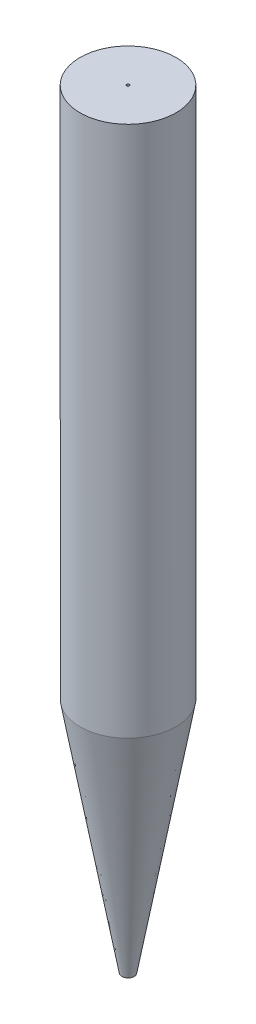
ISO-10303-21;
HEADER;
FILE_DESCRIPTION(('STEP AP214'),'2;1');
FILE_NAME('part.step','',(''),(''),'','','');
FILE_SCHEMA(('AUTOMOTIVE_DESIGN { 1 0 10303 214 1 1 1 1 }'));
ENDSEC;
DATA;
#1=APPLICATION_CONTEXT('core data for automotive mechanical design processes');
#2=APPLICATION_PROTOCOL_DEFINITION('international standard','automotive_design',2000,#1);
#3=PRODUCT_CONTEXT('',#1,'mechanical');
#4=PRODUCT('Part','Part','',(#3));
#5=PRODUCT_RELATED_PRODUCT_CATEGORY('part','',(#4));
#6=PRODUCT_DEFINITION_FORMATION('','',#4);
#7=PRODUCT_DEFINITION_CONTEXT('part definition',#1,'design');
#8=PRODUCT_DEFINITION('design','',#6,#7);
#9=PRODUCT_DEFINITION_SHAPE('','',#8);
#10=(LENGTH_UNIT() NAMED_UNIT(*) SI_UNIT(.MILLI.,.METRE.));
#11=(NAMED_UNIT(*) PLANE_ANGLE_UNIT() SI_UNIT($,.RADIAN.));
#12=(NAMED_UNIT(*) SI_UNIT($,.STERADIAN.) SOLID_ANGLE_UNIT());
#13=UNCERTAINTY_MEASURE_WITH_UNIT(LENGTH_MEASURE(1.E-05),#10,'distance_accuracy_value','');
#14=(GEOMETRIC_REPRESENTATION_CONTEXT(3) GLOBAL_UNCERTAINTY_ASSIGNED_CONTEXT((#13)) GLOBAL_UNIT_ASSIGNED_CONTEXT((#10,
#11,#12)) REPRESENTATION_CONTEXT('',''));
#15=CARTESIAN_POINT('',(0.,0.,0.));
#16=DIRECTION('',(0.,0.,1.));
#17=DIRECTION('',(1.,0.,0.));
#18=AXIS2_PLACEMENT_3D('',#15,#16,#17);
#19=CARTESIAN_POINT('',(0.1016,0.,0.));
#20=DIRECTION('',(0.,-1.,0.));
#21=DIRECTION('',(0.,0.,-1.));
#22=AXIS2_PLACEMENT_3D('',#19,#20,#21);
#23=PLANE('',#22);
#24=CARTESIAN_POINT('',(0.,0.,0.));
#25=DIRECTION('',(0.,-1.,0.));
#26=DIRECTION('',(0.,0.,-1.));
#27=AXIS2_PLACEMENT_3D('',#24,#25,#26);
#28=CIRCLE('',#27,0.02286);
#29=CARTESIAN_POINT('',(0.,0.,-0.02286));
#30=VERTEX_POINT('',#29);
#31=EDGE_CURVE('E50',#30,#30,#28,.F.);
#32=ORIENTED_EDGE('',*,*,#31,.T.);
#33=EDGE_LOOP('',(#32));
#34=FACE_BOUND('',#33,.T.);
#35=CARTESIAN_POINT('',(0.,0.,0.));
#36=DIRECTION('',(0.,-1.,0.));
#37=DIRECTION('',(0.,0.,-1.));
#38=AXIS2_PLACEMENT_3D('',#35,#36,#37);
#39=CIRCLE('',#38,0.1016);
#40=CARTESIAN_POINT('',(0.,0.,0.1016));
#41=VERTEX_POINT('',#40);
#42=EDGE_CURVE('E10',#41,#41,#39,.T.);
#43=ORIENTED_EDGE('',*,*,#42,.T.);
#44=EDGE_LOOP('',(#43));
#45=FACE_BOUND('',#44,.T.);
#46=ADVANCED_FACE('F33',(#34,#45),#23,.T.);
#47=CARTESIAN_POINT('',(0.,0.,0.));
#48=DIRECTION('',(0.,1.,0.));
#49=DIRECTION('',(0.,0.,1.));
#50=AXIS2_PLACEMENT_3D('',#47,#48,#49);
#51=CONICAL_SURFACE('',#50,0.1016,0.174532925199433);
#52=CARTESIAN_POINT('',(0.,3.91817518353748,0.));
#53=DIRECTION('',(0.,-1.,0.));
#54=DIRECTION('',(0.,0.,-1.));
#55=AXIS2_PLACEMENT_3D('',#52,#53,#54);
#56=CIRCLE('',#55,0.79248);
#57=CARTESIAN_POINT('',(0.,3.91817518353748,0.79248));
#58=VERTEX_POINT('',#57);
#59=EDGE_CURVE('E39',#58,#58,#56,.T.);
#60=CARTESIAN_POINT('',(0.,3.91817518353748,0.79248));
#61=CARTESIAN_POINT('',(0.,3.87736085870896,0.785283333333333));
#62=CARTESIAN_POINT('',(0.,3.83654653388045,0.778086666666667));
#63=CARTESIAN_POINT('',(0.,3.75491788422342,0.763693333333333));
#64=CARTESIAN_POINT('',(0.,3.7141035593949,0.756496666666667));
#65=CARTESIAN_POINT('',(0.,3.63247490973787,0.742103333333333));
#66=CARTESIAN_POINT('',(0.,3.59166058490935,0.734906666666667));
#67=CARTESIAN_POINT('',(0.,3.51003193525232,0.720513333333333));
#68=CARTESIAN_POINT('',(0.,3.46921761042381,0.713316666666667));
#69=CARTESIAN_POINT('',(0.,3.38758896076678,0.698923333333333));
#70=CARTESIAN_POINT('',(0.,3.34677463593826,0.691726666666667));
#71=CARTESIAN_POINT('',(0.,3.26514598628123,0.677333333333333));
#72=CARTESIAN_POINT('',(0.,3.22433166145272,0.670136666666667));
#73=CARTESIAN_POINT('',(0.,3.14270301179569,0.655743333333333));
#74=CARTESIAN_POINT('',(0.,3.10188868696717,0.648546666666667));
#75=CARTESIAN_POINT('',(0.,3.02026003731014,0.634153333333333));
#76=CARTESIAN_POINT('',(0.,2.97944571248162,0.626956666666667));
#77=CARTESIAN_POINT('',(0.,2.89781706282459,0.612563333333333));
#78=CARTESIAN_POINT('',(0.,2.85700273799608,0.605366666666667));
#79=CARTESIAN_POINT('',(0.,2.77537408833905,0.590973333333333));
#80=CARTESIAN_POINT('',(0.,2.73455976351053,0.583776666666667));
#81=CARTESIAN_POINT('',(0.,2.6529311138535,0.569383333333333));
#82=CARTESIAN_POINT('',(0.,2.61211678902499,0.562186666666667));
#83=CARTESIAN_POINT('',(0.,2.53048813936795,0.547793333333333));
#84=CARTESIAN_POINT('',(0.,2.48967381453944,0.540596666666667));
#85=CARTESIAN_POINT('',(0.,2.40804516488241,0.526203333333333));
#86=CARTESIAN_POINT('',(0.,2.36723084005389,0.519006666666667));
#87=CARTESIAN_POINT('',(0.,2.28560219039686,0.504613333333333));
#88=CARTESIAN_POINT('',(0.,2.24478786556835,0.497416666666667));
#89=CARTESIAN_POINT('',(0.,2.16315921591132,0.483023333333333));
#90=CARTESIAN_POINT('',(0.,2.1223448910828,0.475826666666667));
#91=CARTESIAN_POINT('',(0.,2.04071624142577,0.461433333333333));
#92=CARTESIAN_POINT('',(0.,1.99990191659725,0.454236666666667));
#93=CARTESIAN_POINT('',(0.,1.91827326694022,0.439843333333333));
#94=CARTESIAN_POINT('',(0.,1.87745894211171,0.432646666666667));
#95=CARTESIAN_POINT('',(0.,1.79583029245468,0.418253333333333));
#96=CARTESIAN_POINT('',(0.,1.75501596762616,0.411056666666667));
#97=CARTESIAN_POINT('',(0.,1.67338731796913,0.396663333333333));
#98=CARTESIAN_POINT('',(0.,1.63257299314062,0.389466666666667));
#99=CARTESIAN_POINT('',(0.,1.55094434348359,0.375073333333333));
#100=CARTESIAN_POINT('',(0.,1.51013001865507,0.367876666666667));
#101=CARTESIAN_POINT('',(0.,1.42850136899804,0.353483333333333));
#102=CARTESIAN_POINT('',(0.,1.38768704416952,0.346286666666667));
#103=CARTESIAN_POINT('',(0.,1.30605839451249,0.331893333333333));
#104=CARTESIAN_POINT('',(0.,1.26524406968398,0.324696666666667));
#105=CARTESIAN_POINT('',(0.,1.18361542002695,0.310303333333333));
#106=CARTESIAN_POINT('',(0.,1.14280109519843,0.303106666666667));
#107=CARTESIAN_POINT('',(0.,1.0611724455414,0.288713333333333));
#108=CARTESIAN_POINT('',(0.,1.02035812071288,0.281516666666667));
#109=CARTESIAN_POINT('',(0.,0.938729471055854,0.267123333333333));
#110=CARTESIAN_POINT('',(0.,0.897915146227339,0.259926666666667));
#111=CARTESIAN_POINT('',(0.,0.816286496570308,0.245533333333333));
#112=CARTESIAN_POINT('',(0.,0.775472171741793,0.238336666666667));
#113=CARTESIAN_POINT('',(0.,0.693843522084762,0.223943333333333));
#114=CARTESIAN_POINT('',(0.,0.653029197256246,0.216746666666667));
#115=CARTESIAN_POINT('',(0.,0.571400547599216,0.202353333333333));
#116=CARTESIAN_POINT('',(0.,0.5305862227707,0.195156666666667));
#117=CARTESIAN_POINT('',(0.,0.448957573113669,0.180763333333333));
#118=CARTESIAN_POINT('',(0.,0.408143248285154,0.173566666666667));
#119=CARTESIAN_POINT('',(0.,0.326514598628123,0.159173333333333));
#120=CARTESIAN_POINT('',(0.,0.285700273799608,0.151976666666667));
#121=CARTESIAN_POINT('',(0.,0.204071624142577,0.137583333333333));
#122=CARTESIAN_POINT('',(0.,0.163257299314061,0.130386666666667));
#123=CARTESIAN_POINT('',(0.,0.0816286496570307,0.115993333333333));
#124=CARTESIAN_POINT('',(0.,0.0408143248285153,0.108796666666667));
#125=CARTESIAN_POINT('',(0.,0.,0.1016));
#126=B_SPLINE_CURVE_WITH_KNOTS('',3,(#60,#61,#62,#63,#64,#65,#66,#67,#68,#69,#70,#71,#72,#73,
#74,#75,#76,#77,#78,#79,#80,#81,#82,#83,#84,#85,#86,#87,#88,#89,#90,#91,#92,#93,#94,#95,#96,#97,
#98,#99,#100,#101,#102,#103,#104,#105,#106,#107,#108,#109,#110,#111,#112,#113,#114,#115,#116,
#117,#118,#119,#120,#121,#122,#123,#124,#125),.UNSPECIFIED.,.F.,.F.,(4,2,2,2,2,2,2,2,2,2,2,2,2,
2,2,2,2,2,2,2,2,2,2,2,2,2,2,2,2,2,2,2,4),(0.,0.124331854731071,0.248663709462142,
0.372995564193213,0.497327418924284,0.621659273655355,0.745991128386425,0.870322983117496,
0.994654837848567,1.11898669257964,1.24331854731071,1.36765040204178,1.49198225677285,
1.61631411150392,1.74064596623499,1.86497782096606,1.98930967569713,2.11364153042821,
2.23797338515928,2.36230523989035,2.48663709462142,2.61096894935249,2.73530080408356,
2.85963265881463,2.9839645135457,3.10829636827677,3.23262822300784,3.35696007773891,
3.48129193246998,3.60562378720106,3.72995564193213,3.8542874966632,3.97861935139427),.UNSPECIFIED.);
#127=EDGE_CURVE('BSEAM67',#58,#41,#126,.T.);
#128=ORIENTED_EDGE('',*,*,#59,.T.);
#129=ORIENTED_EDGE('',*,*,#42,.F.);
#130=ORIENTED_EDGE('',*,*,#127,.T.);
#131=ORIENTED_EDGE('',*,*,#127,.F.);
#132=EDGE_LOOP('',(#128,#130,#129,#131));
#133=FACE_BOUND('',#132,.T.);
#134=ADVANCED_FACE('F67',(#133),#51,.T.);
#135=CARTESIAN_POINT('',(0.,0.,0.));
#136=DIRECTION('',(0.,-1.,0.));
#137=DIRECTION('',(0.,0.,-1.));
#138=AXIS2_PLACEMENT_3D('',#135,#136,#137);
#139=CYLINDRICAL_SURFACE('',#138,0.79248);
#140=CARTESIAN_POINT('',(0.,12.7,0.));
#141=DIRECTION('',(0.,-1.,0.));
#142=DIRECTION('',(0.,0.,-1.));
#143=AXIS2_PLACEMENT_3D('',#140,#141,#142);
#144=CIRCLE('',#143,0.79248);
#145=CARTESIAN_POINT('',(0.,12.7,-0.79248));
#146=VERTEX_POINT('',#145);
#147=EDGE_CURVE('E43',#146,#146,#144,.T.);
#148=ORIENTED_EDGE('',*,*,#147,.T.);
#149=EDGE_LOOP('',(#148));
#150=FACE_BOUND('',#149,.T.);
#151=ORIENTED_EDGE('',*,*,#59,.F.);
#152=EDGE_LOOP('',(#151));
#153=FACE_BOUND('',#152,.T.);
#154=ADVANCED_FACE('F61',(#150,#153),#139,.T.);
#155=CARTESIAN_POINT('',(0.79248,12.7,0.));
#156=DIRECTION('',(0.,1.,0.));
#157=DIRECTION('',(0.,0.,1.));
#158=AXIS2_PLACEMENT_3D('',#155,#156,#157);
#159=PLANE('',#158);
#160=CARTESIAN_POINT('',(0.,12.7,0.));
#161=DIRECTION('',(0.,1.,0.));
#162=DIRECTION('',(0.,0.,1.));
#163=AXIS2_PLACEMENT_3D('',#160,#161,#162);
#164=CIRCLE('',#163,0.02286);
#165=CARTESIAN_POINT('',(0.,12.7,0.02286));
#166=VERTEX_POINT('',#165);
#167=EDGE_CURVE('E47',#166,#166,#164,.T.);
#168=ORIENTED_EDGE('',*,*,#167,.F.);
#169=EDGE_LOOP('',(#168));
#170=FACE_BOUND('',#169,.T.);
#171=ORIENTED_EDGE('',*,*,#147,.F.);
#172=EDGE_LOOP('',(#171));
#173=FACE_BOUND('',#172,.T.);
#174=ADVANCED_FACE('F58',(#170,#173),#159,.T.);
#175=CARTESIAN_POINT('',(0.,-0.000999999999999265,0.));
#176=DIRECTION('',(0.,1.,0.));
#177=DIRECTION('',(0.,0.,1.));
#178=AXIS2_PLACEMENT_3D('',#175,#176,#177);
#179=CYLINDRICAL_SURFACE('',#178,0.02286);
#180=ORIENTED_EDGE('',*,*,#31,.F.);
#181=EDGE_LOOP('',(#180));
#182=FACE_BOUND('',#181,.T.);
#183=ORIENTED_EDGE('',*,*,#167,.T.);
#184=EDGE_LOOP('',(#183));
#185=FACE_BOUND('',#184,.T.);
#186=ADVANCED_FACE('F56',(#182,#185),#179,.F.);
#187=CLOSED_SHELL('',(#46,#134,#154,#174,#186));
#188=MANIFOLD_SOLID_BREP('B2',#187);
#189=ADVANCED_BREP_SHAPE_REPRESENTATION('',(#18,#188),#14);
#190=SHAPE_DEFINITION_REPRESENTATION(#9,#189);
ENDSEC;
END-ISO-10303-21;
